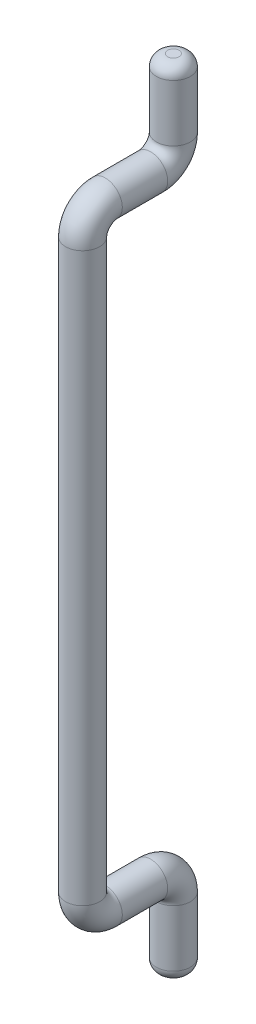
ISO-10303-21;
HEADER;
FILE_DESCRIPTION(('STEP AP214'),'2;1');
FILE_NAME('part.step','',(''),(''),'','','');
FILE_SCHEMA(('AUTOMOTIVE_DESIGN { 1 0 10303 214 1 1 1 1 }'));
ENDSEC;
DATA;
#1=APPLICATION_CONTEXT('core data for automotive mechanical design processes');
#2=APPLICATION_PROTOCOL_DEFINITION('international standard','automotive_design',2000,#1);
#3=PRODUCT_CONTEXT('',#1,'mechanical');
#4=PRODUCT('Part','Part','',(#3));
#5=PRODUCT_RELATED_PRODUCT_CATEGORY('part','',(#4));
#6=PRODUCT_DEFINITION_FORMATION('','',#4);
#7=PRODUCT_DEFINITION_CONTEXT('part definition',#1,'design');
#8=PRODUCT_DEFINITION('design','',#6,#7);
#9=PRODUCT_DEFINITION_SHAPE('','',#8);
#10=(LENGTH_UNIT() NAMED_UNIT(*) SI_UNIT(.MILLI.,.METRE.));
#11=(NAMED_UNIT(*) PLANE_ANGLE_UNIT() SI_UNIT($,.RADIAN.));
#12=(NAMED_UNIT(*) SI_UNIT($,.STERADIAN.) SOLID_ANGLE_UNIT());
#13=UNCERTAINTY_MEASURE_WITH_UNIT(LENGTH_MEASURE(1.E-05),#10,'distance_accuracy_value','');
#14=(GEOMETRIC_REPRESENTATION_CONTEXT(3) GLOBAL_UNCERTAINTY_ASSIGNED_CONTEXT((#13)) GLOBAL_UNIT_ASSIGNED_CONTEXT((#10,
#11,#12)) REPRESENTATION_CONTEXT('',''));
#15=CARTESIAN_POINT('',(0.,0.,0.));
#16=DIRECTION('',(0.,0.,1.));
#17=DIRECTION('',(1.,0.,0.));
#18=AXIS2_PLACEMENT_3D('',#15,#16,#17);
#19=CARTESIAN_POINT('',(0.,0.,0.));
#20=DIRECTION('',(0.,1.,0.));
#21=DIRECTION('',(0.,0.,1.));
#22=AXIS2_PLACEMENT_3D('',#19,#20,#21);
#23=PLANE('',#22);
#24=CARTESIAN_POINT('',(0.,0.,0.));
#25=DIRECTION('',(0.,1.,0.));
#26=DIRECTION('',(0.,0.,1.));
#27=AXIS2_PLACEMENT_3D('',#24,#25,#26);
#28=CIRCLE('',#27,0.25);
#29=CARTESIAN_POINT('',(0.,0.,0.25));
#30=VERTEX_POINT('',#29);
#31=EDGE_CURVE('E10',#30,#30,#28,.F.);
#32=ORIENTED_EDGE('',*,*,#31,.T.);
#33=EDGE_LOOP('',(#32));
#34=FACE_BOUND('',#33,.T.);
#35=ADVANCED_FACE('F45',(#34),#23,.F.);
#36=CARTESIAN_POINT('',(0.,35.,0.));
#37=DIRECTION('',(0.,1.,0.));
#38=DIRECTION('',(0.,0.,1.));
#39=AXIS2_PLACEMENT_3D('',#36,#37,#38);
#40=PLANE('',#39);
#41=CARTESIAN_POINT('',(0.,35.,0.));
#42=DIRECTION('',(0.,1.,0.));
#43=DIRECTION('',(0.,0.,1.));
#44=AXIS2_PLACEMENT_3D('',#41,#42,#43);
#45=CIRCLE('',#44,0.25);
#46=CARTESIAN_POINT('',(0.,35.,0.25));
#47=VERTEX_POINT('',#46);
#48=EDGE_CURVE('E63',#47,#47,#45,.T.);
#49=ORIENTED_EDGE('',*,*,#48,.T.);
#50=EDGE_LOOP('',(#49));
#51=FACE_BOUND('',#50,.T.);
#52=ADVANCED_FACE('F106',(#51),#40,.T.);
#53=CARTESIAN_POINT('',(0.,0.,0.));
#54=DIRECTION('',(0.,1.,0.));
#55=DIRECTION('',(0.,0.,1.));
#56=AXIS2_PLACEMENT_3D('',#53,#54,#55);
#57=CYLINDRICAL_SURFACE('',#56,0.75);
#58=CARTESIAN_POINT('',(0.,0.5,0.));
#59=DIRECTION('',(0.,1.,0.));
#60=DIRECTION('',(0.,0.,1.));
#61=AXIS2_PLACEMENT_3D('',#58,#59,#60);
#62=CIRCLE('',#61,0.75);
#63=CARTESIAN_POINT('',(0.,0.5,0.75));
#64=VERTEX_POINT('',#63);
#65=EDGE_CURVE('E53',#64,#64,#62,.T.);
#66=ORIENTED_EDGE('',*,*,#65,.T.);
#67=EDGE_LOOP('',(#66));
#68=FACE_BOUND('',#67,.T.);
#69=CARTESIAN_POINT('',(0.,3.,0.));
#70=DIRECTION('',(0.,1.,0.));
#71=DIRECTION('',(0.,0.,1.));
#72=AXIS2_PLACEMENT_3D('',#69,#70,#71);
#73=CIRCLE('',#72,0.75);
#74=CARTESIAN_POINT('',(0.,3.,-0.75));
#75=VERTEX_POINT('',#74);
#76=EDGE_CURVE('E97',#75,#75,#73,.T.);
#77=ORIENTED_EDGE('',*,*,#76,.F.);
#78=EDGE_LOOP('',(#77));
#79=FACE_BOUND('',#78,.T.);
#80=ADVANCED_FACE('F104',(#68,#79),#57,.T.);
#81=CARTESIAN_POINT('',(0.,3.,1.));
#82=DIRECTION('',(1.,0.,0.));
#83=DIRECTION('',(0.,0.,-1.));
#84=AXIS2_PLACEMENT_3D('',#81,#82,#83);
#85=TOROIDAL_SURFACE('',#84,1.,0.75);
#86=CARTESIAN_POINT('',(0.,4.,1.));
#87=DIRECTION('',(0.,0.,1.));
#88=DIRECTION('',(0.,-1.,0.));
#89=AXIS2_PLACEMENT_3D('',#86,#87,#88);
#90=CIRCLE('',#89,0.75);
#91=CARTESIAN_POINT('',(0.,4.75,1.));
#92=VERTEX_POINT('',#91);
#93=EDGE_CURVE('E93',#92,#92,#90,.T.);
#94=CARTESIAN_POINT('',(0.,3.,1.));
#95=DIRECTION('',(1.,0.,0.));
#96=DIRECTION('',(0.,0.,-1.));
#97=AXIS2_PLACEMENT_3D('',#94,#95,#96);
#98=CIRCLE('',#97,1.75);
#99=EDGE_CURVE('',#75,#92,#98,.T.);
#100=ORIENTED_EDGE('',*,*,#76,.T.);
#101=ORIENTED_EDGE('',*,*,#93,.F.);
#102=ORIENTED_EDGE('',*,*,#99,.T.);
#103=ORIENTED_EDGE('',*,*,#99,.F.);
#104=EDGE_LOOP('',(#100,#102,#101,#103));
#105=FACE_BOUND('',#104,.T.);
#106=ADVANCED_FACE('F102',(#105),#85,.T.);
#107=CARTESIAN_POINT('',(0.,4.,1.));
#108=DIRECTION('',(0.,0.,1.));
#109=DIRECTION('',(1.,0.,0.));
#110=AXIS2_PLACEMENT_3D('',#107,#108,#109);
#111=CYLINDRICAL_SURFACE('',#110,0.75);
#112=CARTESIAN_POINT('',(0.,4.,3.));
#113=DIRECTION('',(0.,0.,1.));
#114=DIRECTION('',(0.,-1.,0.));
#115=AXIS2_PLACEMENT_3D('',#112,#113,#114);
#116=CIRCLE('',#115,0.75);
#117=CARTESIAN_POINT('',(0.,3.25,3.));
#118=VERTEX_POINT('',#117);
#119=EDGE_CURVE('E89',#118,#118,#116,.T.);
#120=ORIENTED_EDGE('',*,*,#119,.F.);
#121=EDGE_LOOP('',(#120));
#122=FACE_BOUND('',#121,.T.);
#123=ORIENTED_EDGE('',*,*,#93,.T.);
#124=EDGE_LOOP('',(#123));
#125=FACE_BOUND('',#124,.T.);
#126=ADVANCED_FACE('F113',(#122,#125),#111,.T.);
#127=CARTESIAN_POINT('',(0.,5.,3.));
#128=DIRECTION('',(-1.,0.,0.));
#129=DIRECTION('',(0.,0.,1.));
#130=AXIS2_PLACEMENT_3D('',#127,#128,#129);
#131=TOROIDAL_SURFACE('',#130,1.,0.75);
#132=CARTESIAN_POINT('',(0.,5.,4.));
#133=DIRECTION('',(0.,1.,0.));
#134=DIRECTION('',(0.,0.,1.));
#135=AXIS2_PLACEMENT_3D('',#132,#133,#134);
#136=CIRCLE('',#135,0.75);
#137=CARTESIAN_POINT('',(0.,5.,4.75));
#138=VERTEX_POINT('',#137);
#139=EDGE_CURVE('E85',#138,#138,#136,.T.);
#140=CARTESIAN_POINT('',(0.,5.,3.));
#141=DIRECTION('',(-1.,0.,0.));
#142=DIRECTION('',(0.,0.,1.));
#143=AXIS2_PLACEMENT_3D('',#140,#141,#142);
#144=CIRCLE('',#143,1.75);
#145=EDGE_CURVE('',#118,#138,#144,.T.);
#146=ORIENTED_EDGE('',*,*,#119,.T.);
#147=ORIENTED_EDGE('',*,*,#139,.F.);
#148=ORIENTED_EDGE('',*,*,#145,.T.);
#149=ORIENTED_EDGE('',*,*,#145,.F.);
#150=EDGE_LOOP('',(#146,#148,#147,#149));
#151=FACE_BOUND('',#150,.T.);
#152=ADVANCED_FACE('F165',(#151),#131,.T.);
#153=CARTESIAN_POINT('',(0.,5.,4.));
#154=DIRECTION('',(0.,1.,0.));
#155=DIRECTION('',(-1.,0.,0.));
#156=AXIS2_PLACEMENT_3D('',#153,#154,#155);
#157=CYLINDRICAL_SURFACE('',#156,0.75);
#158=CARTESIAN_POINT('',(0.,30.,4.));
#159=DIRECTION('',(0.,1.,0.));
#160=DIRECTION('',(0.,0.,1.));
#161=AXIS2_PLACEMENT_3D('',#158,#159,#160);
#162=CIRCLE('',#161,0.75);
#163=CARTESIAN_POINT('',(0.,30.,4.75));
#164=VERTEX_POINT('',#163);
#165=EDGE_CURVE('E81',#164,#164,#162,.T.);
#166=ORIENTED_EDGE('',*,*,#165,.F.);
#167=EDGE_LOOP('',(#166));
#168=FACE_BOUND('',#167,.T.);
#169=ORIENTED_EDGE('',*,*,#139,.T.);
#170=EDGE_LOOP('',(#169));
#171=FACE_BOUND('',#170,.T.);
#172=ADVANCED_FACE('F175',(#168,#171),#157,.T.);
#173=CARTESIAN_POINT('',(0.,30.,3.));
#174=DIRECTION('',(-1.,0.,0.));
#175=DIRECTION('',(0.,0.,1.));
#176=AXIS2_PLACEMENT_3D('',#173,#174,#175);
#177=TOROIDAL_SURFACE('',#176,1.,0.75);
#178=CARTESIAN_POINT('',(0.,31.,3.));
#179=DIRECTION('',(0.,0.,-1.));
#180=DIRECTION('',(0.,1.,0.));
#181=AXIS2_PLACEMENT_3D('',#178,#179,#180);
#182=CIRCLE('',#181,0.75);
#183=CARTESIAN_POINT('',(0.,31.75,3.));
#184=VERTEX_POINT('',#183);
#185=EDGE_CURVE('E77',#184,#184,#182,.T.);
#186=CARTESIAN_POINT('',(0.,30.,3.));
#187=DIRECTION('',(-1.,0.,0.));
#188=DIRECTION('',(0.,0.,1.));
#189=AXIS2_PLACEMENT_3D('',#186,#187,#188);
#190=CIRCLE('',#189,1.75);
#191=EDGE_CURVE('',#164,#184,#190,.T.);
#192=ORIENTED_EDGE('',*,*,#165,.T.);
#193=ORIENTED_EDGE('',*,*,#185,.F.);
#194=ORIENTED_EDGE('',*,*,#191,.T.);
#195=ORIENTED_EDGE('',*,*,#191,.F.);
#196=EDGE_LOOP('',(#192,#194,#193,#195));
#197=FACE_BOUND('',#196,.T.);
#198=ADVANCED_FACE('F185',(#197),#177,.T.);
#199=CARTESIAN_POINT('',(0.,31.,3.));
#200=DIRECTION('',(0.,0.,-1.));
#201=DIRECTION('',(-1.,0.,0.));
#202=AXIS2_PLACEMENT_3D('',#199,#200,#201);
#203=CYLINDRICAL_SURFACE('',#202,0.75);
#204=CARTESIAN_POINT('',(0.,31.,1.));
#205=DIRECTION('',(0.,0.,-1.));
#206=DIRECTION('',(0.,1.,0.));
#207=AXIS2_PLACEMENT_3D('',#204,#205,#206);
#208=CIRCLE('',#207,0.75);
#209=CARTESIAN_POINT('',(0.,30.25,1.));
#210=VERTEX_POINT('',#209);
#211=EDGE_CURVE('E73',#210,#210,#208,.T.);
#212=ORIENTED_EDGE('',*,*,#211,.F.);
#213=EDGE_LOOP('',(#212));
#214=FACE_BOUND('',#213,.T.);
#215=ORIENTED_EDGE('',*,*,#185,.T.);
#216=EDGE_LOOP('',(#215));
#217=FACE_BOUND('',#216,.T.);
#218=ADVANCED_FACE('F128',(#214,#217),#203,.T.);
#219=CARTESIAN_POINT('',(0.,32.,1.));
#220=DIRECTION('',(1.,0.,0.));
#221=DIRECTION('',(0.,0.,-1.));
#222=AXIS2_PLACEMENT_3D('',#219,#220,#221);
#223=TOROIDAL_SURFACE('',#222,1.,0.75);
#224=CARTESIAN_POINT('',(0.,32.,0.));
#225=DIRECTION('',(0.,1.,0.));
#226=DIRECTION('',(0.,0.,1.));
#227=AXIS2_PLACEMENT_3D('',#224,#225,#226);
#228=CIRCLE('',#227,0.75);
#229=CARTESIAN_POINT('',(0.,32.,-0.750000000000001));
#230=VERTEX_POINT('',#229);
#231=EDGE_CURVE('E69',#230,#230,#228,.T.);
#232=CARTESIAN_POINT('',(0.,32.,1.));
#233=DIRECTION('',(1.,0.,0.));
#234=DIRECTION('',(0.,0.,-1.));
#235=AXIS2_PLACEMENT_3D('',#232,#233,#234);
#236=CIRCLE('',#235,1.75);
#237=EDGE_CURVE('',#210,#230,#236,.T.);
#238=ORIENTED_EDGE('',*,*,#211,.T.);
#239=ORIENTED_EDGE('',*,*,#231,.F.);
#240=ORIENTED_EDGE('',*,*,#237,.T.);
#241=ORIENTED_EDGE('',*,*,#237,.F.);
#242=EDGE_LOOP('',(#238,#240,#239,#241));
#243=FACE_BOUND('',#242,.T.);
#244=ADVANCED_FACE('F120',(#243),#223,.T.);
#245=CARTESIAN_POINT('',(0.,32.,0.));
#246=DIRECTION('',(0.,1.,0.));
#247=DIRECTION('',(0.,0.,1.));
#248=AXIS2_PLACEMENT_3D('',#245,#246,#247);
#249=CYLINDRICAL_SURFACE('',#248,0.75);
#250=CARTESIAN_POINT('',(0.,34.5,0.));
#251=DIRECTION('',(0.,1.,0.));
#252=DIRECTION('',(0.,0.,1.));
#253=AXIS2_PLACEMENT_3D('',#250,#251,#252);
#254=CIRCLE('',#253,0.75);
#255=CARTESIAN_POINT('',(0.,34.5,0.75));
#256=VERTEX_POINT('',#255);
#257=EDGE_CURVE('E58',#256,#256,#254,.F.);
#258=ORIENTED_EDGE('',*,*,#257,.T.);
#259=EDGE_LOOP('',(#258));
#260=FACE_BOUND('',#259,.T.);
#261=ORIENTED_EDGE('',*,*,#231,.T.);
#262=EDGE_LOOP('',(#261));
#263=FACE_BOUND('',#262,.T.);
#264=ADVANCED_FACE('F118',(#260,#263),#249,.T.);
#265=CARTESIAN_POINT('',(0.,34.5,0.));
#266=DIRECTION('',(0.,1.,0.));
#267=DIRECTION('',(0.,0.,1.));
#268=AXIS2_PLACEMENT_3D('',#265,#266,#267);
#269=DEGENERATE_TOROIDAL_SURFACE('',#268,0.25,0.5,.T.);
#270=ORIENTED_EDGE('',*,*,#257,.F.);
#271=EDGE_LOOP('',(#270));
#272=FACE_BOUND('',#271,.T.);
#273=ORIENTED_EDGE('',*,*,#48,.F.);
#274=EDGE_LOOP('',(#273));
#275=FACE_BOUND('',#274,.T.);
#276=ADVANCED_FACE('F119',(#272,#275),#269,.T.);
#277=CARTESIAN_POINT('',(0.,0.5,0.));
#278=DIRECTION('',(0.,1.,0.));
#279=DIRECTION('',(0.,0.,1.));
#280=AXIS2_PLACEMENT_3D('',#277,#278,#279);
#281=DEGENERATE_TOROIDAL_SURFACE('',#280,0.25,0.5,.T.);
#282=ORIENTED_EDGE('',*,*,#31,.F.);
#283=EDGE_LOOP('',(#282));
#284=FACE_BOUND('',#283,.T.);
#285=ORIENTED_EDGE('',*,*,#65,.F.);
#286=EDGE_LOOP('',(#285));
#287=FACE_BOUND('',#286,.T.);
#288=ADVANCED_FACE('F47',(#284,#287),#281,.T.);
#289=CLOSED_SHELL('',(#35,#52,#80,#106,#126,#152,#172,#198,#218,#244,#264,#276,#288));
#290=MANIFOLD_SOLID_BREP('B2',#289);
#291=ADVANCED_BREP_SHAPE_REPRESENTATION('',(#18,#290),#14);
#292=SHAPE_DEFINITION_REPRESENTATION(#9,#291);
ENDSEC;
END-ISO-10303-21;
